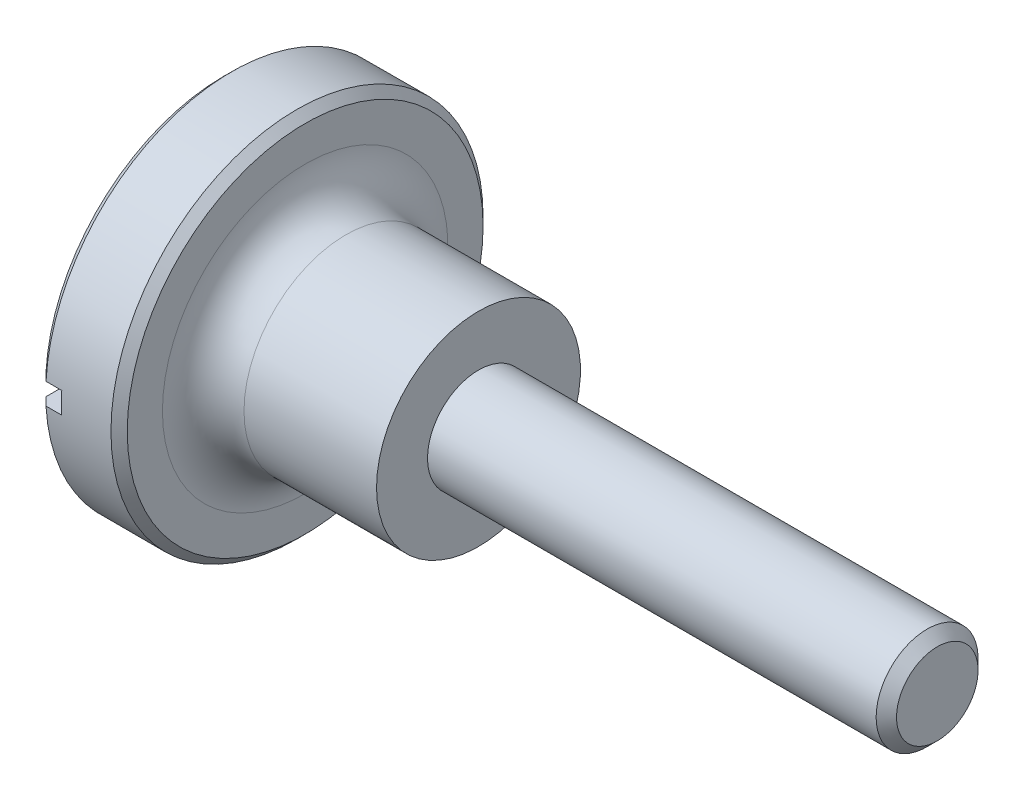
from build123d import *

# Parameters (mm, degrees)
SLOT_DEPTH      = 75.606467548
SLOT_DEPTH_BACK = 75.606467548
SLOTSKE_W       = 4.69310445
SLOTSKE_H       = 2.101390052
FILLET1_R       = 4


with BuildPart() as part:
    # BodySke → Base-Revolve (revolve)
    with BuildSketch(Plane.XY, mode=Mode.PRIVATE) as base_revolve_sk:
        Polygon((69, 5), (70, 4), (70, 0), (0, 0), (0, 17.45), (0.8, 18.25), (7.2, 18.25), (8, 17.45), (8, 10), (25, 10), (25, 5), align=None)
    revolve(base_revolve_sk.sketch.rotate(Axis((-25.4, 0, 0), (1, 0, 0)), 90), axis=Axis((-25.4, 0, 0), (1, 0, 0)))

    # SlotSke → Slot (cut, two sides: drawn at the far end of the back side and taken through both)
    with BuildSketch(Plane.XY.offset(-SLOT_DEPTH_BACK)):
        Rectangle(SLOTSKE_W, SLOTSKE_H)
    extrude(amount=SLOT_DEPTH + SLOT_DEPTH_BACK, mode=Mode.SUBTRACT)

    # Fillet1
    fillet1_edges = [part.edges().sort_by_distance(p)[0] for p in [
        (8, 0, -10),
    ]]
    fillet(fillet1_edges, radius=FILLET1_R)


solid = part.part
